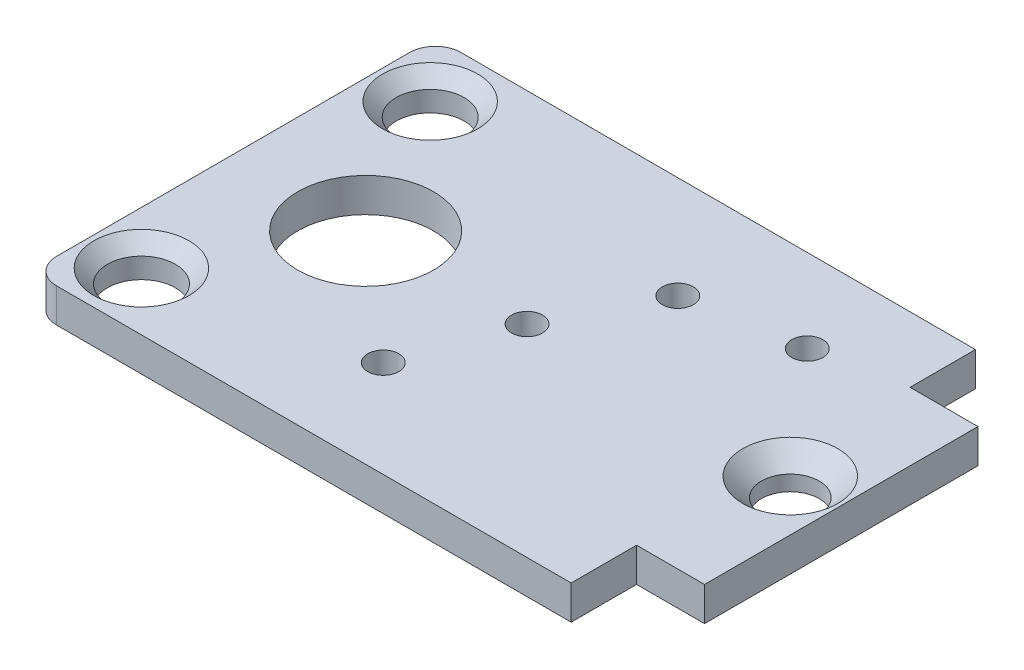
ISO-10303-21;
HEADER;
FILE_DESCRIPTION(('STEP AP214'),'2;1');
FILE_NAME('part.step','',(''),(''),'','','');
FILE_SCHEMA(('AUTOMOTIVE_DESIGN { 1 0 10303 214 1 1 1 1 }'));
ENDSEC;
DATA;
#1=APPLICATION_CONTEXT('core data for automotive mechanical design processes');
#2=APPLICATION_PROTOCOL_DEFINITION('international standard','automotive_design',2000,#1);
#3=PRODUCT_CONTEXT('',#1,'mechanical');
#4=PRODUCT('Part','Part','',(#3));
#5=PRODUCT_RELATED_PRODUCT_CATEGORY('part','',(#4));
#6=PRODUCT_DEFINITION_FORMATION('','',#4);
#7=PRODUCT_DEFINITION_CONTEXT('part definition',#1,'design');
#8=PRODUCT_DEFINITION('design','',#6,#7);
#9=PRODUCT_DEFINITION_SHAPE('','',#8);
#10=(LENGTH_UNIT() NAMED_UNIT(*) SI_UNIT(.MILLI.,.METRE.));
#11=(NAMED_UNIT(*) PLANE_ANGLE_UNIT() SI_UNIT($,.RADIAN.));
#12=(NAMED_UNIT(*) SI_UNIT($,.STERADIAN.) SOLID_ANGLE_UNIT());
#13=UNCERTAINTY_MEASURE_WITH_UNIT(LENGTH_MEASURE(1.E-05),#10,'distance_accuracy_value','');
#14=(GEOMETRIC_REPRESENTATION_CONTEXT(3) GLOBAL_UNCERTAINTY_ASSIGNED_CONTEXT((#13)) GLOBAL_UNIT_ASSIGNED_CONTEXT((#10,
#11,#12)) REPRESENTATION_CONTEXT('',''));
#15=CARTESIAN_POINT('',(0.,0.,0.));
#16=DIRECTION('',(0.,0.,1.));
#17=DIRECTION('',(1.,0.,0.));
#18=AXIS2_PLACEMENT_3D('',#15,#16,#17);
#19=CARTESIAN_POINT('',(0.,1.,0.));
#20=DIRECTION('',(0.,-1.,0.));
#21=DIRECTION('',(0.,0.,-1.));
#22=AXIS2_PLACEMENT_3D('',#19,#20,#21);
#23=PLANE('',#22);
#24=CARTESIAN_POINT('',(12.5,1.,0.));
#25=DIRECTION('',(0.,1.,0.));
#26=DIRECTION('',(0.,0.,1.));
#27=AXIS2_PLACEMENT_3D('',#24,#25,#26);
#28=CIRCLE('',#27,1.4);
#29=CARTESIAN_POINT('',(12.5,1.,1.4));
#30=VERTEX_POINT('',#29);
#31=EDGE_CURVE('E368',#30,#30,#28,.T.);
#32=ORIENTED_EDGE('',*,*,#31,.F.);
#33=EDGE_LOOP('',(#32));
#34=FACE_BOUND('',#33,.T.);
#35=CARTESIAN_POINT('',(3.61862915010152,1.,3.1));
#36=DIRECTION('',(0.,1.,0.));
#37=DIRECTION('',(0.,0.,1.));
#38=AXIS2_PLACEMENT_3D('',#35,#36,#37);
#39=CIRCLE('',#38,0.457200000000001);
#40=CARTESIAN_POINT('',(3.61862915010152,1.,3.5572));
#41=VERTEX_POINT('',#40);
#42=EDGE_CURVE('E270',#41,#41,#39,.T.);
#43=ORIENTED_EDGE('',*,*,#42,.F.);
#44=EDGE_LOOP('',(#43));
#45=FACE_BOUND('',#44,.T.);
#46=CARTESIAN_POINT('',(4.75,1.,0.));
#47=DIRECTION('',(0.,1.,0.));
#48=DIRECTION('',(0.,0.,1.));
#49=AXIS2_PLACEMENT_3D('',#46,#47,#48);
#50=CIRCLE('',#49,0.4572);
#51=CARTESIAN_POINT('',(4.75,1.,0.4572));
#52=VERTEX_POINT('',#51);
#53=EDGE_CURVE('E386',#52,#52,#50,.T.);
#54=ORIENTED_EDGE('',*,*,#53,.F.);
#55=EDGE_LOOP('',(#54));
#56=FACE_BOUND('',#55,.T.);
#57=CARTESIAN_POINT('',(6.24777213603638,1.,-2.94052352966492));
#58=DIRECTION('',(0.,1.,0.));
#59=DIRECTION('',(0.,0.,1.));
#60=AXIS2_PLACEMENT_3D('',#57,#58,#59);
#61=CIRCLE('',#60,0.4572);
#62=CARTESIAN_POINT('',(6.24777213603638,1.,-2.48332352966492));
#63=VERTEX_POINT('',#62);
#64=EDGE_CURVE('E394',#63,#63,#61,.T.);
#65=ORIENTED_EDGE('',*,*,#64,.F.);
#66=EDGE_LOOP('',(#65));
#67=FACE_BOUND('',#66,.T.);
#68=CARTESIAN_POINT('',(9.5,1.,-3.5));
#69=DIRECTION('',(0.,1.,0.));
#70=DIRECTION('',(0.,0.,1.));
#71=AXIS2_PLACEMENT_3D('',#68,#69,#70);
#72=CIRCLE('',#71,0.4572);
#73=CARTESIAN_POINT('',(9.5,1.,-3.0428));
#74=VERTEX_POINT('',#73);
#75=EDGE_CURVE('E377',#74,#74,#72,.T.);
#76=ORIENTED_EDGE('',*,*,#75,.F.);
#77=EDGE_LOOP('',(#76));
#78=FACE_BOUND('',#77,.T.);
#79=CARTESIAN_POINT('',(-2.34999999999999,1.,4.25));
#80=DIRECTION('',(0.,-1.,0.));
#81=DIRECTION('',(0.,0.,-1.));
#82=AXIS2_PLACEMENT_3D('',#79,#80,#81);
#83=CIRCLE('',#82,1.4);
#84=CARTESIAN_POINT('',(-2.34999999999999,1.,2.85));
#85=VERTEX_POINT('',#84);
#86=EDGE_CURVE('E52',#85,#85,#83,.T.);
#87=ORIENTED_EDGE('',*,*,#86,.T.);
#88=EDGE_LOOP('',(#87));
#89=FACE_BOUND('',#88,.T.);
#90=CARTESIAN_POINT('',(-2.34999999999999,1.,-4.25));
#91=DIRECTION('',(0.,-1.,0.));
#92=DIRECTION('',(0.,0.,-1.));
#93=AXIS2_PLACEMENT_3D('',#90,#91,#92);
#94=CIRCLE('',#93,1.4);
#95=CARTESIAN_POINT('',(-2.34999999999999,1.,-2.85));
#96=VERTEX_POINT('',#95);
#97=EDGE_CURVE('E235',#96,#96,#94,.T.);
#98=ORIENTED_EDGE('',*,*,#97,.T.);
#99=EDGE_LOOP('',(#98));
#100=FACE_BOUND('',#99,.T.);
#101=DIRECTION('',(-1.,0.,0.));
#102=VECTOR('',#101,1.);
#103=CARTESIAN_POINT('',(12.,1.,-5.95));
#104=LINE('',#103,#102);
#105=CARTESIAN_POINT('',(12.,1.,-5.95));
#106=VERTEX_POINT('',#105);
#107=CARTESIAN_POINT('',(-3.15,1.,-5.95));
#108=VERTEX_POINT('',#107);
#109=EDGE_CURVE('E163',#106,#108,#104,.T.);
#110=ORIENTED_EDGE('',*,*,#109,.T.);
#111=CARTESIAN_POINT('',(-3.14999999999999,1.,-5.2));
#112=DIRECTION('',(0.,-1.,0.));
#113=DIRECTION('',(0.,0.,-1.));
#114=AXIS2_PLACEMENT_3D('',#111,#112,#113);
#115=CIRCLE('',#114,0.75);
#116=CARTESIAN_POINT('',(-3.89999999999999,1.,-5.2));
#117=VERTEX_POINT('',#116);
#118=EDGE_CURVE('E225',#108,#117,#115,.F.);
#119=ORIENTED_EDGE('',*,*,#118,.T.);
#120=DIRECTION('',(0.,0.,1.));
#121=VECTOR('',#120,1.);
#122=CARTESIAN_POINT('',(-3.89999999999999,1.,-5.95));
#123=LINE('',#122,#121);
#124=CARTESIAN_POINT('',(-3.89999999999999,1.,5.2));
#125=VERTEX_POINT('',#124);
#126=EDGE_CURVE('E131',#117,#125,#123,.T.);
#127=ORIENTED_EDGE('',*,*,#126,.T.);
#128=CARTESIAN_POINT('',(-3.15,1.,5.2));
#129=DIRECTION('',(0.,-1.,0.));
#130=DIRECTION('',(0.,0.,-1.));
#131=AXIS2_PLACEMENT_3D('',#128,#129,#130);
#132=CIRCLE('',#131,0.75);
#133=CARTESIAN_POINT('',(-3.15,1.,5.95));
#134=VERTEX_POINT('',#133);
#135=EDGE_CURVE('E59',#125,#134,#132,.F.);
#136=ORIENTED_EDGE('',*,*,#135,.T.);
#137=DIRECTION('',(1.,0.,0.));
#138=VECTOR('',#137,1.);
#139=CARTESIAN_POINT('',(12.,1.,5.95));
#140=LINE('',#139,#138);
#141=CARTESIAN_POINT('',(12.,1.,5.95));
#142=VERTEX_POINT('',#141);
#143=EDGE_CURVE('E121',#134,#142,#140,.T.);
#144=ORIENTED_EDGE('',*,*,#143,.T.);
#145=DIRECTION('',(0.,0.,-1.));
#146=VECTOR('',#145,1.);
#147=CARTESIAN_POINT('',(12.,1.,5.95));
#148=LINE('',#147,#146);
#149=CARTESIAN_POINT('',(12.,1.,4.025));
#150=VERTEX_POINT('',#149);
#151=EDGE_CURVE('E125',#142,#150,#148,.T.);
#152=ORIENTED_EDGE('',*,*,#151,.T.);
#153=DIRECTION('',(1.,0.,0.));
#154=VECTOR('',#153,1.);
#155=CARTESIAN_POINT('',(12.,1.,4.025));
#156=LINE('',#155,#154);
#157=CARTESIAN_POINT('',(14.,1.,4.025));
#158=VERTEX_POINT('',#157);
#159=EDGE_CURVE('E148',#150,#158,#156,.T.);
#160=ORIENTED_EDGE('',*,*,#159,.T.);
#161=DIRECTION('',(0.,0.,-1.));
#162=VECTOR('',#161,1.);
#163=CARTESIAN_POINT('',(14.,1.,-4.025));
#164=LINE('',#163,#162);
#165=CARTESIAN_POINT('',(14.,1.,-4.025));
#166=VERTEX_POINT('',#165);
#167=EDGE_CURVE('E151',#158,#166,#164,.T.);
#168=ORIENTED_EDGE('',*,*,#167,.T.);
#169=DIRECTION('',(-1.,0.,0.));
#170=VECTOR('',#169,1.);
#171=CARTESIAN_POINT('',(12.,1.,-4.025));
#172=LINE('',#171,#170);
#173=CARTESIAN_POINT('',(12.,1.,-4.025));
#174=VERTEX_POINT('',#173);
#175=EDGE_CURVE('E157',#166,#174,#172,.T.);
#176=ORIENTED_EDGE('',*,*,#175,.T.);
#177=DIRECTION('',(0.,0.,-1.));
#178=VECTOR('',#177,1.);
#179=CARTESIAN_POINT('',(12.,1.,-5.95));
#180=LINE('',#179,#178);
#181=EDGE_CURVE('E160',#174,#106,#180,.T.);
#182=ORIENTED_EDGE('',*,*,#181,.T.);
#183=EDGE_LOOP('',(#110,#119,#127,#136,#144,#152,#160,#168,#176,#182));
#184=FACE_BOUND('',#183,.T.);
#185=CARTESIAN_POINT('',(0.,1.,0.));
#186=DIRECTION('',(0.,1.,0.));
#187=DIRECTION('',(0.,0.,1.));
#188=AXIS2_PLACEMENT_3D('',#185,#186,#187);
#189=CIRCLE('',#188,2.);
#190=CARTESIAN_POINT('',(0.,1.,2.));
#191=VERTEX_POINT('',#190);
#192=EDGE_CURVE('E171',#191,#191,#189,.T.);
#193=ORIENTED_EDGE('',*,*,#192,.F.);
#194=EDGE_LOOP('',(#193));
#195=FACE_BOUND('',#194,.T.);
#196=ADVANCED_FACE('F42',(#34,#45,#56,#67,#78,#89,#100,#184,#195),#23,.F.);
#197=CARTESIAN_POINT('',(0.,0.,0.));
#198=DIRECTION('',(0.,-1.,0.));
#199=DIRECTION('',(0.,0.,-1.));
#200=AXIS2_PLACEMENT_3D('',#197,#198,#199);
#201=PLANE('',#200);
#202=CARTESIAN_POINT('',(12.5,0.,0.));
#203=DIRECTION('',(0.,1.,0.));
#204=DIRECTION('',(0.,0.,1.));
#205=AXIS2_PLACEMENT_3D('',#202,#203,#204);
#206=CIRCLE('',#205,0.849999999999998);
#207=CARTESIAN_POINT('',(12.5,0.,0.849999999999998));
#208=VERTEX_POINT('',#207);
#209=EDGE_CURVE('E372',#208,#208,#206,.T.);
#210=ORIENTED_EDGE('',*,*,#209,.T.);
#211=EDGE_LOOP('',(#210));
#212=FACE_BOUND('',#211,.T.);
#213=CARTESIAN_POINT('',(3.61862915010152,0.,3.1));
#214=DIRECTION('',(0.,1.,0.));
#215=DIRECTION('',(0.,0.,1.));
#216=AXIS2_PLACEMENT_3D('',#213,#214,#215);
#217=CIRCLE('',#216,0.457200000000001);
#218=CARTESIAN_POINT('',(3.61862915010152,0.,3.5572));
#219=VERTEX_POINT('',#218);
#220=EDGE_CURVE('E262',#219,#219,#217,.T.);
#221=ORIENTED_EDGE('',*,*,#220,.T.);
#222=EDGE_LOOP('',(#221));
#223=FACE_BOUND('',#222,.T.);
#224=CARTESIAN_POINT('',(4.75,0.,0.));
#225=DIRECTION('',(0.,1.,0.));
#226=DIRECTION('',(0.,0.,1.));
#227=AXIS2_PLACEMENT_3D('',#224,#225,#226);
#228=CIRCLE('',#227,0.4572);
#229=CARTESIAN_POINT('',(4.75,0.,0.4572));
#230=VERTEX_POINT('',#229);
#231=EDGE_CURVE('E382',#230,#230,#228,.T.);
#232=ORIENTED_EDGE('',*,*,#231,.T.);
#233=EDGE_LOOP('',(#232));
#234=FACE_BOUND('',#233,.T.);
#235=CARTESIAN_POINT('',(6.24777213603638,0.,-2.94052352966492));
#236=DIRECTION('',(0.,1.,0.));
#237=DIRECTION('',(0.,0.,1.));
#238=AXIS2_PLACEMENT_3D('',#235,#236,#237);
#239=CIRCLE('',#238,0.4572);
#240=CARTESIAN_POINT('',(6.24777213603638,0.,-2.48332352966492));
#241=VERTEX_POINT('',#240);
#242=EDGE_CURVE('E390',#241,#241,#239,.T.);
#243=ORIENTED_EDGE('',*,*,#242,.T.);
#244=EDGE_LOOP('',(#243));
#245=FACE_BOUND('',#244,.T.);
#246=CARTESIAN_POINT('',(9.5,0.,-3.5));
#247=DIRECTION('',(0.,1.,0.));
#248=DIRECTION('',(0.,0.,1.));
#249=AXIS2_PLACEMENT_3D('',#246,#247,#248);
#250=CIRCLE('',#249,0.4572);
#251=CARTESIAN_POINT('',(9.5,0.,-3.0428));
#252=VERTEX_POINT('',#251);
#253=EDGE_CURVE('E398',#252,#252,#250,.T.);
#254=ORIENTED_EDGE('',*,*,#253,.T.);
#255=EDGE_LOOP('',(#254));
#256=FACE_BOUND('',#255,.T.);
#257=CARTESIAN_POINT('',(-2.34999999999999,0.,-4.25));
#258=DIRECTION('',(0.,1.,0.));
#259=DIRECTION('',(0.,0.,1.));
#260=AXIS2_PLACEMENT_3D('',#257,#258,#259);
#261=CIRCLE('',#260,1.);
#262=CARTESIAN_POINT('',(-2.34999999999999,0.,-3.25));
#263=VERTEX_POINT('',#262);
#264=EDGE_CURVE('E261',#263,#263,#261,.T.);
#265=ORIENTED_EDGE('',*,*,#264,.T.);
#266=EDGE_LOOP('',(#265));
#267=FACE_BOUND('',#266,.T.);
#268=CARTESIAN_POINT('',(-2.34999999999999,0.,4.25));
#269=DIRECTION('',(0.,1.,0.));
#270=DIRECTION('',(0.,0.,1.));
#271=AXIS2_PLACEMENT_3D('',#268,#269,#270);
#272=CIRCLE('',#271,1.);
#273=CARTESIAN_POINT('',(-2.34999999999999,0.,5.25));
#274=VERTEX_POINT('',#273);
#275=EDGE_CURVE('E258',#274,#274,#272,.T.);
#276=ORIENTED_EDGE('',*,*,#275,.T.);
#277=EDGE_LOOP('',(#276));
#278=FACE_BOUND('',#277,.T.);
#279=DIRECTION('',(0.,0.,1.));
#280=VECTOR('',#279,1.);
#281=CARTESIAN_POINT('',(-3.89999999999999,0.,-5.95));
#282=LINE('',#281,#280);
#283=CARTESIAN_POINT('',(-3.89999999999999,0.,-5.2));
#284=VERTEX_POINT('',#283);
#285=CARTESIAN_POINT('',(-3.89999999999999,0.,5.2));
#286=VERTEX_POINT('',#285);
#287=EDGE_CURVE('E167',#284,#286,#282,.T.);
#288=ORIENTED_EDGE('',*,*,#287,.F.);
#289=CARTESIAN_POINT('',(-3.14999999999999,0.,-5.2));
#290=DIRECTION('',(0.,-1.,0.));
#291=DIRECTION('',(0.,0.,-1.));
#292=AXIS2_PLACEMENT_3D('',#289,#290,#291);
#293=CIRCLE('',#292,0.75);
#294=CARTESIAN_POINT('',(-3.15,0.,-5.95));
#295=VERTEX_POINT('',#294);
#296=EDGE_CURVE('E218',#284,#295,#293,.T.);
#297=ORIENTED_EDGE('',*,*,#296,.T.);
#298=DIRECTION('',(-1.,0.,0.));
#299=VECTOR('',#298,1.);
#300=CARTESIAN_POINT('',(12.,0.,-5.95));
#301=LINE('',#300,#299);
#302=CARTESIAN_POINT('',(12.,0.,-5.95));
#303=VERTEX_POINT('',#302);
#304=EDGE_CURVE('E189',#303,#295,#301,.T.);
#305=ORIENTED_EDGE('',*,*,#304,.F.);
#306=DIRECTION('',(0.,0.,-1.));
#307=VECTOR('',#306,1.);
#308=CARTESIAN_POINT('',(12.,0.,-5.95));
#309=LINE('',#308,#307);
#310=CARTESIAN_POINT('',(12.,0.,-4.025));
#311=VERTEX_POINT('',#310);
#312=EDGE_CURVE('E186',#311,#303,#309,.T.);
#313=ORIENTED_EDGE('',*,*,#312,.F.);
#314=DIRECTION('',(-1.,0.,0.));
#315=VECTOR('',#314,1.);
#316=CARTESIAN_POINT('',(12.,0.,-4.025));
#317=LINE('',#316,#315);
#318=CARTESIAN_POINT('',(14.,0.,-4.025));
#319=VERTEX_POINT('',#318);
#320=EDGE_CURVE('E183',#319,#311,#317,.T.);
#321=ORIENTED_EDGE('',*,*,#320,.F.);
#322=DIRECTION('',(0.,0.,-1.));
#323=VECTOR('',#322,1.);
#324=CARTESIAN_POINT('',(14.,0.,-4.025));
#325=LINE('',#324,#323);
#326=CARTESIAN_POINT('',(14.,0.,4.025));
#327=VERTEX_POINT('',#326);
#328=EDGE_CURVE('E180',#327,#319,#325,.T.);
#329=ORIENTED_EDGE('',*,*,#328,.F.);
#330=DIRECTION('',(1.,0.,0.));
#331=VECTOR('',#330,1.);
#332=CARTESIAN_POINT('',(12.,0.,4.025));
#333=LINE('',#332,#331);
#334=CARTESIAN_POINT('',(12.,0.,4.025));
#335=VERTEX_POINT('',#334);
#336=EDGE_CURVE('E177',#335,#327,#333,.T.);
#337=ORIENTED_EDGE('',*,*,#336,.F.);
#338=DIRECTION('',(0.,0.,-1.));
#339=VECTOR('',#338,1.);
#340=CARTESIAN_POINT('',(12.,0.,5.95));
#341=LINE('',#340,#339);
#342=CARTESIAN_POINT('',(12.,0.,5.95));
#343=VERTEX_POINT('',#342);
#344=EDGE_CURVE('E174',#343,#335,#341,.T.);
#345=ORIENTED_EDGE('',*,*,#344,.F.);
#346=DIRECTION('',(1.,0.,0.));
#347=VECTOR('',#346,1.);
#348=CARTESIAN_POINT('',(12.,0.,5.95));
#349=LINE('',#348,#347);
#350=CARTESIAN_POINT('',(-3.15,0.,5.95));
#351=VERTEX_POINT('',#350);
#352=EDGE_CURVE('E137',#351,#343,#349,.T.);
#353=ORIENTED_EDGE('',*,*,#352,.F.);
#354=CARTESIAN_POINT('',(-3.15,0.,5.2));
#355=DIRECTION('',(0.,-1.,0.));
#356=DIRECTION('',(0.,0.,-1.));
#357=AXIS2_PLACEMENT_3D('',#354,#355,#356);
#358=CIRCLE('',#357,0.75);
#359=EDGE_CURVE('E215',#351,#286,#358,.T.);
#360=ORIENTED_EDGE('',*,*,#359,.T.);
#361=EDGE_LOOP('',(#288,#297,#305,#313,#321,#329,#337,#345,#353,#360));
#362=FACE_BOUND('',#361,.T.);
#363=CARTESIAN_POINT('',(0.,0.,0.));
#364=DIRECTION('',(0.,1.,0.));
#365=DIRECTION('',(0.,0.,1.));
#366=AXIS2_PLACEMENT_3D('',#363,#364,#365);
#367=CIRCLE('',#366,2.);
#368=CARTESIAN_POINT('',(0.,0.,2.));
#369=VERTEX_POINT('',#368);
#370=EDGE_CURVE('E267',#369,#369,#367,.T.);
#371=ORIENTED_EDGE('',*,*,#370,.T.);
#372=EDGE_LOOP('',(#371));
#373=FACE_BOUND('',#372,.T.);
#374=ADVANCED_FACE('F288',(#212,#223,#234,#245,#256,#267,#278,#362,#373),#201,.T.);
#375=CARTESIAN_POINT('',(-3.89999999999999,1.,-5.95));
#376=DIRECTION('',(1.,0.,0.));
#377=DIRECTION('',(0.,0.,-1.));
#378=AXIS2_PLACEMENT_3D('',#375,#376,#377);
#379=PLANE('',#378);
#380=ORIENTED_EDGE('',*,*,#126,.F.);
#381=DIRECTION('',(0.,-1.,0.));
#382=VECTOR('',#381,1.);
#383=CARTESIAN_POINT('',(-3.89999999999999,1.,-5.2));
#384=LINE('',#383,#382);
#385=EDGE_CURVE('E211',#117,#284,#384,.T.);
#386=ORIENTED_EDGE('',*,*,#385,.T.);
#387=ORIENTED_EDGE('',*,*,#287,.T.);
#388=DIRECTION('',(0.,-1.,0.));
#389=VECTOR('',#388,1.);
#390=CARTESIAN_POINT('',(-3.89999999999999,1.,5.2));
#391=LINE('',#390,#389);
#392=EDGE_CURVE('E141',#286,#125,#391,.F.);
#393=ORIENTED_EDGE('',*,*,#392,.T.);
#394=EDGE_LOOP('',(#380,#386,#387,#393));
#395=FACE_BOUND('',#394,.T.);
#396=ADVANCED_FACE('F311',(#395),#379,.F.);
#397=CARTESIAN_POINT('',(12.,1.,5.95));
#398=DIRECTION('',(0.,0.,-1.));
#399=DIRECTION('',(-1.,0.,0.));
#400=AXIS2_PLACEMENT_3D('',#397,#398,#399);
#401=PLANE('',#400);
#402=ORIENTED_EDGE('',*,*,#143,.F.);
#403=DIRECTION('',(0.,-1.,0.));
#404=VECTOR('',#403,1.);
#405=CARTESIAN_POINT('',(-3.15,1.,5.95));
#406=LINE('',#405,#404);
#407=EDGE_CURVE('E228',#134,#351,#406,.T.);
#408=ORIENTED_EDGE('',*,*,#407,.T.);
#409=ORIENTED_EDGE('',*,*,#352,.T.);
#410=DIRECTION('',(0.,-1.,0.));
#411=VECTOR('',#410,1.);
#412=CARTESIAN_POINT('',(12.,1.,5.95));
#413=LINE('',#412,#411);
#414=EDGE_CURVE('E134',#142,#343,#413,.T.);
#415=ORIENTED_EDGE('',*,*,#414,.F.);
#416=EDGE_LOOP('',(#402,#408,#409,#415));
#417=FACE_BOUND('',#416,.T.);
#418=ADVANCED_FACE('F135',(#417),#401,.F.);
#419=CARTESIAN_POINT('',(12.,1.,5.95));
#420=DIRECTION('',(-1.,0.,0.));
#421=DIRECTION('',(0.,0.,1.));
#422=AXIS2_PLACEMENT_3D('',#419,#420,#421);
#423=PLANE('',#422);
#424=ORIENTED_EDGE('',*,*,#344,.T.);
#425=DIRECTION('',(0.,-1.,0.));
#426=VECTOR('',#425,1.);
#427=CARTESIAN_POINT('',(12.,1.,4.025));
#428=LINE('',#427,#426);
#429=EDGE_CURVE('E142',#150,#335,#428,.T.);
#430=ORIENTED_EDGE('',*,*,#429,.F.);
#431=ORIENTED_EDGE('',*,*,#151,.F.);
#432=ORIENTED_EDGE('',*,*,#414,.T.);
#433=EDGE_LOOP('',(#424,#430,#431,#432));
#434=FACE_BOUND('',#433,.T.);
#435=ADVANCED_FACE('F144',(#434),#423,.F.);
#436=CARTESIAN_POINT('',(12.,1.,4.025));
#437=DIRECTION('',(0.,0.,-1.));
#438=DIRECTION('',(-1.,0.,0.));
#439=AXIS2_PLACEMENT_3D('',#436,#437,#438);
#440=PLANE('',#439);
#441=ORIENTED_EDGE('',*,*,#336,.T.);
#442=DIRECTION('',(0.,-1.,0.));
#443=VECTOR('',#442,1.);
#444=CARTESIAN_POINT('',(14.,1.,4.025));
#445=LINE('',#444,#443);
#446=EDGE_CURVE('E203',#158,#327,#445,.T.);
#447=ORIENTED_EDGE('',*,*,#446,.F.);
#448=ORIENTED_EDGE('',*,*,#159,.F.);
#449=ORIENTED_EDGE('',*,*,#429,.T.);
#450=EDGE_LOOP('',(#441,#447,#448,#449));
#451=FACE_BOUND('',#450,.T.);
#452=ADVANCED_FACE('F293',(#451),#440,.F.);
#453=CARTESIAN_POINT('',(14.,1.,-4.025));
#454=DIRECTION('',(-1.,0.,0.));
#455=DIRECTION('',(0.,0.,1.));
#456=AXIS2_PLACEMENT_3D('',#453,#454,#455);
#457=PLANE('',#456);
#458=ORIENTED_EDGE('',*,*,#328,.T.);
#459=DIRECTION('',(0.,-1.,0.));
#460=VECTOR('',#459,1.);
#461=CARTESIAN_POINT('',(14.,1.,-4.025));
#462=LINE('',#461,#460);
#463=EDGE_CURVE('E199',#166,#319,#462,.T.);
#464=ORIENTED_EDGE('',*,*,#463,.F.);
#465=ORIENTED_EDGE('',*,*,#167,.F.);
#466=ORIENTED_EDGE('',*,*,#446,.T.);
#467=EDGE_LOOP('',(#458,#464,#465,#466));
#468=FACE_BOUND('',#467,.T.);
#469=ADVANCED_FACE('F300',(#468),#457,.F.);
#470=CARTESIAN_POINT('',(12.,1.,-4.025));
#471=DIRECTION('',(0.,0.,1.));
#472=DIRECTION('',(1.,0.,0.));
#473=AXIS2_PLACEMENT_3D('',#470,#471,#472);
#474=PLANE('',#473);
#475=ORIENTED_EDGE('',*,*,#320,.T.);
#476=DIRECTION('',(0.,-1.,0.));
#477=VECTOR('',#476,1.);
#478=CARTESIAN_POINT('',(12.,1.,-4.025));
#479=LINE('',#478,#477);
#480=EDGE_CURVE('E195',#174,#311,#479,.T.);
#481=ORIENTED_EDGE('',*,*,#480,.F.);
#482=ORIENTED_EDGE('',*,*,#175,.F.);
#483=ORIENTED_EDGE('',*,*,#463,.T.);
#484=EDGE_LOOP('',(#475,#481,#482,#483));
#485=FACE_BOUND('',#484,.T.);
#486=ADVANCED_FACE('F303',(#485),#474,.F.);
#487=CARTESIAN_POINT('',(12.,1.,-5.95));
#488=DIRECTION('',(-1.,0.,0.));
#489=DIRECTION('',(0.,0.,1.));
#490=AXIS2_PLACEMENT_3D('',#487,#488,#489);
#491=PLANE('',#490);
#492=ORIENTED_EDGE('',*,*,#312,.T.);
#493=DIRECTION('',(0.,-1.,0.));
#494=VECTOR('',#493,1.);
#495=CARTESIAN_POINT('',(12.,1.,-5.95));
#496=LINE('',#495,#494);
#497=EDGE_CURVE('E166',#106,#303,#496,.T.);
#498=ORIENTED_EDGE('',*,*,#497,.F.);
#499=ORIENTED_EDGE('',*,*,#181,.F.);
#500=ORIENTED_EDGE('',*,*,#480,.T.);
#501=EDGE_LOOP('',(#492,#498,#499,#500));
#502=FACE_BOUND('',#501,.T.);
#503=ADVANCED_FACE('F308',(#502),#491,.F.);
#504=CARTESIAN_POINT('',(12.,1.,-5.95));
#505=DIRECTION('',(0.,0.,1.));
#506=DIRECTION('',(1.,0.,0.));
#507=AXIS2_PLACEMENT_3D('',#504,#505,#506);
#508=PLANE('',#507);
#509=ORIENTED_EDGE('',*,*,#304,.T.);
#510=DIRECTION('',(0.,-1.,0.));
#511=VECTOR('',#510,1.);
#512=CARTESIAN_POINT('',(-3.15,1.,-5.95));
#513=LINE('',#512,#511);
#514=EDGE_CURVE('E67',#295,#108,#513,.F.);
#515=ORIENTED_EDGE('',*,*,#514,.T.);
#516=ORIENTED_EDGE('',*,*,#109,.F.);
#517=ORIENTED_EDGE('',*,*,#497,.T.);
#518=EDGE_LOOP('',(#509,#515,#516,#517));
#519=FACE_BOUND('',#518,.T.);
#520=ADVANCED_FACE('F313',(#519),#508,.F.);
#521=CARTESIAN_POINT('',(0.,1.,0.));
#522=DIRECTION('',(0.,-1.,0.));
#523=DIRECTION('',(0.,0.,-1.));
#524=AXIS2_PLACEMENT_3D('',#521,#522,#523);
#525=CYLINDRICAL_SURFACE('',#524,2.);
#526=ORIENTED_EDGE('',*,*,#192,.T.);
#527=EDGE_LOOP('',(#526));
#528=FACE_BOUND('',#527,.T.);
#529=ORIENTED_EDGE('',*,*,#370,.F.);
#530=EDGE_LOOP('',(#529));
#531=FACE_BOUND('',#530,.T.);
#532=ADVANCED_FACE('F254',(#528,#531),#525,.F.);
#533=CARTESIAN_POINT('',(-2.34999999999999,0.,4.25));
#534=DIRECTION('',(0.,1.,0.));
#535=DIRECTION('',(0.,0.,1.));
#536=AXIS2_PLACEMENT_3D('',#533,#534,#535);
#537=CYLINDRICAL_SURFACE('',#536,1.);
#538=CARTESIAN_POINT('',(-2.34999999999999,0.600000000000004,4.25));
#539=DIRECTION('',(0.,-1.,0.));
#540=DIRECTION('',(0.,0.,-1.));
#541=AXIS2_PLACEMENT_3D('',#538,#539,#540);
#542=CIRCLE('',#541,1.);
#543=CARTESIAN_POINT('',(-2.34999999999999,0.600000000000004,3.25));
#544=VERTEX_POINT('',#543);
#545=EDGE_CURVE('E231',#544,#544,#542,.F.);
#546=ORIENTED_EDGE('',*,*,#545,.T.);
#547=EDGE_LOOP('',(#546));
#548=FACE_BOUND('',#547,.T.);
#549=ORIENTED_EDGE('',*,*,#275,.F.);
#550=EDGE_LOOP('',(#549));
#551=FACE_BOUND('',#550,.T.);
#552=ADVANCED_FACE('F250',(#548,#551),#537,.F.);
#553=CARTESIAN_POINT('',(-2.34999999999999,0.,-4.25));
#554=DIRECTION('',(0.,1.,0.));
#555=DIRECTION('',(0.,0.,1.));
#556=AXIS2_PLACEMENT_3D('',#553,#554,#555);
#557=CYLINDRICAL_SURFACE('',#556,1.);
#558=CARTESIAN_POINT('',(-2.34999999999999,0.600000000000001,-4.25));
#559=DIRECTION('',(0.,-1.,0.));
#560=DIRECTION('',(0.,0.,-1.));
#561=AXIS2_PLACEMENT_3D('',#558,#559,#560);
#562=CIRCLE('',#561,1.);
#563=CARTESIAN_POINT('',(-2.34999999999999,0.600000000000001,-3.25));
#564=VERTEX_POINT('',#563);
#565=EDGE_CURVE('E11',#564,#564,#562,.F.);
#566=ORIENTED_EDGE('',*,*,#565,.T.);
#567=EDGE_LOOP('',(#566));
#568=FACE_BOUND('',#567,.T.);
#569=ORIENTED_EDGE('',*,*,#264,.F.);
#570=EDGE_LOOP('',(#569));
#571=FACE_BOUND('',#570,.T.);
#572=ADVANCED_FACE('F253',(#568,#571),#557,.F.);
#573=CARTESIAN_POINT('',(-3.14999999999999,1.,-5.2));
#574=DIRECTION('',(0.,-1.,0.));
#575=DIRECTION('',(0.,0.,-1.));
#576=AXIS2_PLACEMENT_3D('',#573,#574,#575);
#577=CYLINDRICAL_SURFACE('',#576,0.75);
#578=ORIENTED_EDGE('',*,*,#118,.F.);
#579=ORIENTED_EDGE('',*,*,#514,.F.);
#580=ORIENTED_EDGE('',*,*,#296,.F.);
#581=ORIENTED_EDGE('',*,*,#385,.F.);
#582=EDGE_LOOP('',(#578,#579,#580,#581));
#583=FACE_BOUND('',#582,.T.);
#584=ADVANCED_FACE('F310',(#583),#577,.T.);
#585=CARTESIAN_POINT('',(-3.15,1.,5.2));
#586=DIRECTION('',(0.,-1.,0.));
#587=DIRECTION('',(0.,0.,-1.));
#588=AXIS2_PLACEMENT_3D('',#585,#586,#587);
#589=CYLINDRICAL_SURFACE('',#588,0.75);
#590=ORIENTED_EDGE('',*,*,#135,.F.);
#591=ORIENTED_EDGE('',*,*,#392,.F.);
#592=ORIENTED_EDGE('',*,*,#359,.F.);
#593=ORIENTED_EDGE('',*,*,#407,.F.);
#594=EDGE_LOOP('',(#590,#591,#592,#593));
#595=FACE_BOUND('',#594,.T.);
#596=ADVANCED_FACE('F247',(#595),#589,.T.);
#597=CARTESIAN_POINT('',(-2.34999999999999,0.600000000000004,4.25));
#598=DIRECTION('',(0.,1.,0.));
#599=DIRECTION('',(0.,0.,1.));
#600=AXIS2_PLACEMENT_3D('',#597,#598,#599);
#601=CONICAL_SURFACE('',#600,1.,0.785398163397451);
#602=ORIENTED_EDGE('',*,*,#86,.F.);
#603=EDGE_LOOP('',(#602));
#604=FACE_BOUND('',#603,.T.);
#605=ORIENTED_EDGE('',*,*,#545,.F.);
#606=EDGE_LOOP('',(#605));
#607=FACE_BOUND('',#606,.T.);
#608=ADVANCED_FACE('F244',(#604,#607),#601,.F.);
#609=CARTESIAN_POINT('',(-2.34999999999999,0.600000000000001,-4.25));
#610=DIRECTION('',(0.,1.,0.));
#611=DIRECTION('',(0.,0.,1.));
#612=AXIS2_PLACEMENT_3D('',#609,#610,#611);
#613=CONICAL_SURFACE('',#612,1.,0.785398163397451);
#614=CARTESIAN_POINT('',(-2.34999999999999,1.,-2.85));
#615=CARTESIAN_POINT('',(-2.34999999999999,0.995833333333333,-2.85416666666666));
#616=CARTESIAN_POINT('',(-2.34999999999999,0.991666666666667,-2.85833333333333));
#617=CARTESIAN_POINT('',(-2.34999999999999,0.983333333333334,-2.86666666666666));
#618=CARTESIAN_POINT('',(-2.34999999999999,0.979166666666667,-2.87083333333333));
#619=CARTESIAN_POINT('',(-2.34999999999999,0.970833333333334,-2.87916666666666));
#620=CARTESIAN_POINT('',(-2.34999999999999,0.966666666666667,-2.88333333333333));
#621=CARTESIAN_POINT('',(-2.34999999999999,0.958333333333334,-2.89166666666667));
#622=CARTESIAN_POINT('',(-2.34999999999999,0.954166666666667,-2.89583333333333));
#623=CARTESIAN_POINT('',(-2.34999999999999,0.945833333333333,-2.90416666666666));
#624=CARTESIAN_POINT('',(-2.34999999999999,0.941666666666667,-2.90833333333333));
#625=CARTESIAN_POINT('',(-2.34999999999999,0.933333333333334,-2.91666666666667));
#626=CARTESIAN_POINT('',(-2.34999999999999,0.929166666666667,-2.92083333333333));
#627=CARTESIAN_POINT('',(-2.34999999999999,0.920833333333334,-2.92916666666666));
#628=CARTESIAN_POINT('',(-2.34999999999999,0.916666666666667,-2.93333333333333));
#629=CARTESIAN_POINT('',(-2.34999999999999,0.908333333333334,-2.94166666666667));
#630=CARTESIAN_POINT('',(-2.34999999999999,0.904166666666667,-2.94583333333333));
#631=CARTESIAN_POINT('',(-2.34999999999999,0.895833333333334,-2.95416666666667));
#632=CARTESIAN_POINT('',(-2.34999999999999,0.891666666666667,-2.95833333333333));
#633=CARTESIAN_POINT('',(-2.34999999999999,0.883333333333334,-2.96666666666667));
#634=CARTESIAN_POINT('',(-2.34999999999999,0.879166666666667,-2.97083333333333));
#635=CARTESIAN_POINT('',(-2.34999999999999,0.870833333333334,-2.97916666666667));
#636=CARTESIAN_POINT('',(-2.34999999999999,0.866666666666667,-2.98333333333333));
#637=CARTESIAN_POINT('',(-2.34999999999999,0.858333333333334,-2.99166666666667));
#638=CARTESIAN_POINT('',(-2.34999999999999,0.854166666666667,-2.99583333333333));
#639=CARTESIAN_POINT('',(-2.34999999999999,0.845833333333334,-3.00416666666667));
#640=CARTESIAN_POINT('',(-2.34999999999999,0.841666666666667,-3.00833333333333));
#641=CARTESIAN_POINT('',(-2.34999999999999,0.833333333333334,-3.01666666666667));
#642=CARTESIAN_POINT('',(-2.34999999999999,0.829166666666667,-3.02083333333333));
#643=CARTESIAN_POINT('',(-2.34999999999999,0.820833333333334,-3.02916666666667));
#644=CARTESIAN_POINT('',(-2.34999999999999,0.816666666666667,-3.03333333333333));
#645=CARTESIAN_POINT('',(-2.34999999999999,0.808333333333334,-3.04166666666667));
#646=CARTESIAN_POINT('',(-2.34999999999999,0.804166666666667,-3.04583333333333));
#647=CARTESIAN_POINT('',(-2.34999999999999,0.795833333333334,-3.05416666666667));
#648=CARTESIAN_POINT('',(-2.34999999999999,0.791666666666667,-3.05833333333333));
#649=CARTESIAN_POINT('',(-2.34999999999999,0.783333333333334,-3.06666666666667));
#650=CARTESIAN_POINT('',(-2.34999999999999,0.779166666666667,-3.07083333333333));
#651=CARTESIAN_POINT('',(-2.34999999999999,0.770833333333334,-3.07916666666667));
#652=CARTESIAN_POINT('',(-2.34999999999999,0.766666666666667,-3.08333333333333));
#653=CARTESIAN_POINT('',(-2.34999999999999,0.758333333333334,-3.09166666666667));
#654=CARTESIAN_POINT('',(-2.34999999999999,0.754166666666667,-3.09583333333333));
#655=CARTESIAN_POINT('',(-2.34999999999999,0.745833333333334,-3.10416666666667));
#656=CARTESIAN_POINT('',(-2.34999999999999,0.741666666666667,-3.10833333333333));
#657=CARTESIAN_POINT('',(-2.34999999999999,0.733333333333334,-3.11666666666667));
#658=CARTESIAN_POINT('',(-2.34999999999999,0.729166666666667,-3.12083333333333));
#659=CARTESIAN_POINT('',(-2.34999999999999,0.720833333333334,-3.12916666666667));
#660=CARTESIAN_POINT('',(-2.34999999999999,0.716666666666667,-3.13333333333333));
#661=CARTESIAN_POINT('',(-2.34999999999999,0.708333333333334,-3.14166666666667));
#662=CARTESIAN_POINT('',(-2.34999999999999,0.704166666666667,-3.14583333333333));
#663=CARTESIAN_POINT('',(-2.34999999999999,0.695833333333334,-3.15416666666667));
#664=CARTESIAN_POINT('',(-2.34999999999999,0.691666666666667,-3.15833333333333));
#665=CARTESIAN_POINT('',(-2.34999999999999,0.683333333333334,-3.16666666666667));
#666=CARTESIAN_POINT('',(-2.34999999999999,0.679166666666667,-3.17083333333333));
#667=CARTESIAN_POINT('',(-2.34999999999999,0.670833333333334,-3.17916666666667));
#668=CARTESIAN_POINT('',(-2.34999999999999,0.666666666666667,-3.18333333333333));
#669=CARTESIAN_POINT('',(-2.34999999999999,0.658333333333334,-3.19166666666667));
#670=CARTESIAN_POINT('',(-2.34999999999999,0.654166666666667,-3.19583333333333));
#671=CARTESIAN_POINT('',(-2.34999999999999,0.645833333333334,-3.20416666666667));
#672=CARTESIAN_POINT('',(-2.34999999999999,0.641666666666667,-3.20833333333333));
#673=CARTESIAN_POINT('',(-2.34999999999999,0.633333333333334,-3.21666666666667));
#674=CARTESIAN_POINT('',(-2.34999999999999,0.629166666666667,-3.22083333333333));
#675=CARTESIAN_POINT('',(-2.34999999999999,0.620833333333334,-3.22916666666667));
#676=CARTESIAN_POINT('',(-2.34999999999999,0.616666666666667,-3.23333333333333));
#677=CARTESIAN_POINT('',(-2.34999999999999,0.608333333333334,-3.24166666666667));
#678=CARTESIAN_POINT('',(-2.34999999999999,0.604166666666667,-3.24583333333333));
#679=CARTESIAN_POINT('',(-2.34999999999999,0.600000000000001,-3.25));
#680=B_SPLINE_CURVE_WITH_KNOTS('',3,(#614,#615,#616,#617,#618,#619,#620,#621,#622,#623,#624,
#625,#626,#627,#628,#629,#630,#631,#632,#633,#634,#635,#636,#637,#638,#639,#640,#641,#642,#643,
#644,#645,#646,#647,#648,#649,#650,#651,#652,#653,#654,#655,#656,#657,#658,#659,#660,#661,#662,
#663,#664,#665,#666,#667,#668,#669,#670,#671,#672,#673,#674,#675,#676,#677,#678,#679),
.UNSPECIFIED.,.F.,.F.,(4,2,2,2,2,2,2,2,2,2,2,2,2,2,2,2,2,2,2,2,2,2,2,2,2,2,2,2,2,2,2,2,4),(0.,
0.0176776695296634,0.0353553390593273,0.0530330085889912,0.0707106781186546,0.0883883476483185,
0.106066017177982,0.123743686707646,0.14142135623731,0.159099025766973,0.176776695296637,
0.194454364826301,0.212132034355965,0.229809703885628,0.247487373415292,0.265165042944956,
0.282842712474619,0.300520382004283,0.318198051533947,0.33587572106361,0.353553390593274,
0.371231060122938,0.388908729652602,0.406586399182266,0.424264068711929,0.441941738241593,
0.459619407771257,0.47729707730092,0.494974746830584,0.512652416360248,0.530330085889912,
0.548007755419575,0.565685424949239),.UNSPECIFIED.);
#681=EDGE_CURVE('BSEAM45',#96,#564,#680,.T.);
#682=ORIENTED_EDGE('',*,*,#97,.F.);
#683=ORIENTED_EDGE('',*,*,#565,.F.);
#684=ORIENTED_EDGE('',*,*,#681,.T.);
#685=ORIENTED_EDGE('',*,*,#681,.F.);
#686=EDGE_LOOP('',(#682,#684,#683,#685));
#687=FACE_BOUND('',#686,.T.);
#688=ADVANCED_FACE('F45',(#687),#613,.F.);
#689=CARTESIAN_POINT('',(9.5,0.,-3.5));
#690=DIRECTION('',(0.,1.,0.));
#691=DIRECTION('',(0.,0.,1.));
#692=AXIS2_PLACEMENT_3D('',#689,#690,#691);
#693=CYLINDRICAL_SURFACE('',#692,0.4572);
#694=ORIENTED_EDGE('',*,*,#253,.F.);
#695=EDGE_LOOP('',(#694));
#696=FACE_BOUND('',#695,.T.);
#697=ORIENTED_EDGE('',*,*,#75,.T.);
#698=EDGE_LOOP('',(#697));
#699=FACE_BOUND('',#698,.T.);
#700=ADVANCED_FACE('F338',(#696,#699),#693,.F.);
#701=CARTESIAN_POINT('',(6.24777213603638,0.,-2.94052352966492));
#702=DIRECTION('',(0.,1.,0.));
#703=DIRECTION('',(0.,0.,1.));
#704=AXIS2_PLACEMENT_3D('',#701,#702,#703);
#705=CYLINDRICAL_SURFACE('',#704,0.4572);
#706=ORIENTED_EDGE('',*,*,#242,.F.);
#707=EDGE_LOOP('',(#706));
#708=FACE_BOUND('',#707,.T.);
#709=ORIENTED_EDGE('',*,*,#64,.T.);
#710=EDGE_LOOP('',(#709));
#711=FACE_BOUND('',#710,.T.);
#712=ADVANCED_FACE('F341',(#708,#711),#705,.F.);
#713=CARTESIAN_POINT('',(4.75,0.,0.));
#714=DIRECTION('',(0.,1.,0.));
#715=DIRECTION('',(0.,0.,1.));
#716=AXIS2_PLACEMENT_3D('',#713,#714,#715);
#717=CYLINDRICAL_SURFACE('',#716,0.4572);
#718=ORIENTED_EDGE('',*,*,#231,.F.);
#719=EDGE_LOOP('',(#718));
#720=FACE_BOUND('',#719,.T.);
#721=ORIENTED_EDGE('',*,*,#53,.T.);
#722=EDGE_LOOP('',(#721));
#723=FACE_BOUND('',#722,.T.);
#724=ADVANCED_FACE('F345',(#720,#723),#717,.F.);
#725=CARTESIAN_POINT('',(3.61862915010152,0.,3.1));
#726=DIRECTION('',(0.,1.,0.));
#727=DIRECTION('',(0.,0.,1.));
#728=AXIS2_PLACEMENT_3D('',#725,#726,#727);
#729=CYLINDRICAL_SURFACE('',#728,0.457200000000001);
#730=ORIENTED_EDGE('',*,*,#220,.F.);
#731=EDGE_LOOP('',(#730));
#732=FACE_BOUND('',#731,.T.);
#733=ORIENTED_EDGE('',*,*,#42,.T.);
#734=EDGE_LOOP('',(#733));
#735=FACE_BOUND('',#734,.T.);
#736=ADVANCED_FACE('F349',(#732,#735),#729,.F.);
#737=CARTESIAN_POINT('',(12.5,1.,0.));
#738=DIRECTION('',(0.,1.,0.));
#739=DIRECTION('',(0.,0.,1.));
#740=AXIS2_PLACEMENT_3D('',#737,#738,#739);
#741=CYLINDRICAL_SURFACE('',#740,0.849999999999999);
#742=ORIENTED_EDGE('',*,*,#209,.F.);
#743=EDGE_LOOP('',(#742));
#744=FACE_BOUND('',#743,.T.);
#745=CARTESIAN_POINT('',(12.5,0.45,0.));
#746=DIRECTION('',(0.,1.,0.));
#747=DIRECTION('',(0.,0.,1.));
#748=AXIS2_PLACEMENT_3D('',#745,#746,#747);
#749=CIRCLE('',#748,0.85);
#750=CARTESIAN_POINT('',(12.5,0.45,0.85));
#751=VERTEX_POINT('',#750);
#752=EDGE_CURVE('E366',#751,#751,#749,.T.);
#753=ORIENTED_EDGE('',*,*,#752,.T.);
#754=EDGE_LOOP('',(#753));
#755=FACE_BOUND('',#754,.T.);
#756=ADVANCED_FACE('F353',(#744,#755),#741,.F.);
#757=CARTESIAN_POINT('',(12.5,1.,0.));
#758=DIRECTION('',(0.,1.,0.));
#759=DIRECTION('',(0.,0.,1.));
#760=AXIS2_PLACEMENT_3D('',#757,#758,#759);
#761=CONICAL_SURFACE('',#760,1.4,0.785398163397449);
#762=ORIENTED_EDGE('',*,*,#752,.F.);
#763=EDGE_LOOP('',(#762));
#764=FACE_BOUND('',#763,.T.);
#765=ORIENTED_EDGE('',*,*,#31,.T.);
#766=EDGE_LOOP('',(#765));
#767=FACE_BOUND('',#766,.T.);
#768=ADVANCED_FACE('F357',(#764,#767),#761,.F.);
#769=CLOSED_SHELL('',(#196,#374,#396,#418,#435,#452,#469,#486,#503,#520,#532,#552,#572,#584,
#596,#608,#688,#700,#712,#724,#736,#756,#768));
#770=MANIFOLD_SOLID_BREP('B2',#769);
#771=ADVANCED_BREP_SHAPE_REPRESENTATION('',(#18,#770),#14);
#772=SHAPE_DEFINITION_REPRESENTATION(#9,#771);
ENDSEC;
END-ISO-10303-21;
